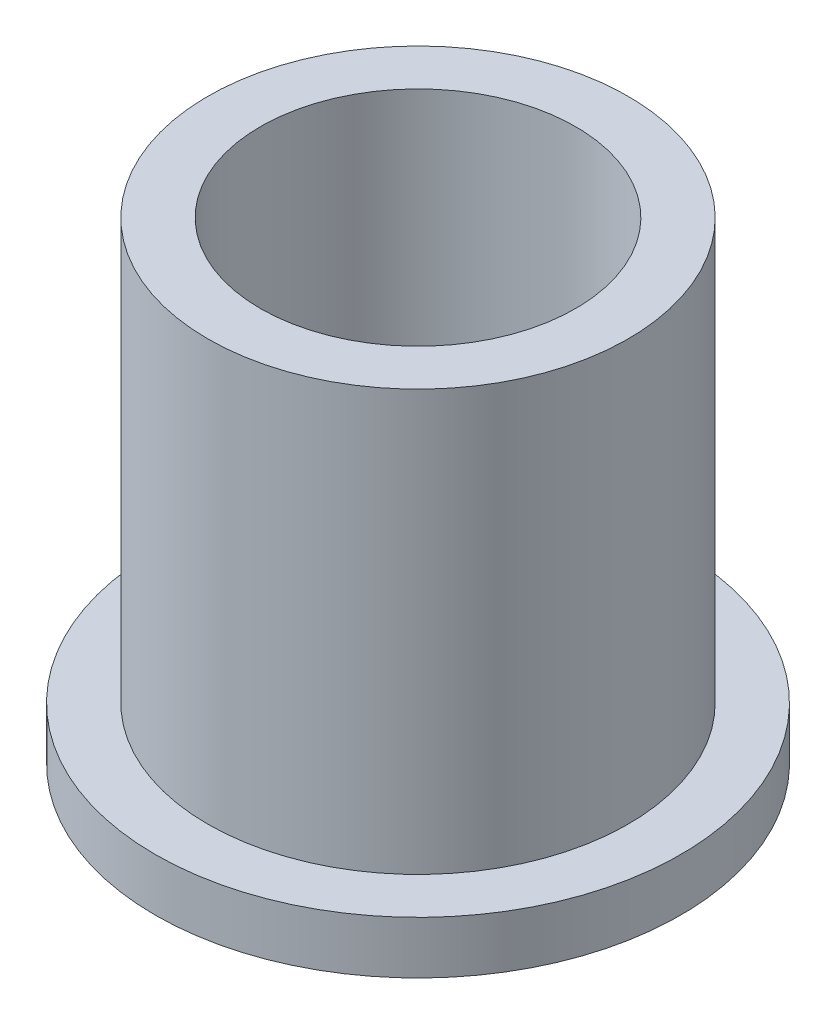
from build123d import *

# Parameters (mm, degrees)
SKETCH1_R           = 6.35
SKETCH1_R_2         = 4.7625
BOSS_EXTRUDE1_DEPTH = 12.7
SKETCH2_R           = 7.9375
SKETCH2_R_2         = 4.7625
BOSS_EXTRUDE2_DEPTH = 1.5875


with BuildPart() as part:
    # Sketch1 → Boss-Extrude1 (new body)
    with BuildSketch(Plane(origin=(0, 0, 0), x_dir=(1, 0, 0), z_dir=(0, 1, 0))):
        with Locations(Location((0, 0, 0), (0, 0, 270))):
            Circle(SKETCH1_R)
        with Locations(Location((0, 0, 0), (0, 0, 270))):
            Circle(SKETCH1_R_2, mode=Mode.SUBTRACT)
    extrude(amount=BOSS_EXTRUDE1_DEPTH)


with BuildPart() as body_2:
    # Sketch2 → Boss-Extrude2 (new body)
    with BuildSketch(Plane.XZ):
        with Locations(Location((0, 0, 0), (0, 0, 270))):
            Circle(SKETCH2_R)
        with Locations(Location((0, 0, 0), (0, 0, 270))):
            Circle(SKETCH2_R_2, mode=Mode.SUBTRACT)
    extrude(amount=BOSS_EXTRUDE2_DEPTH)


solid = Compound([part.part, body_2.part])
